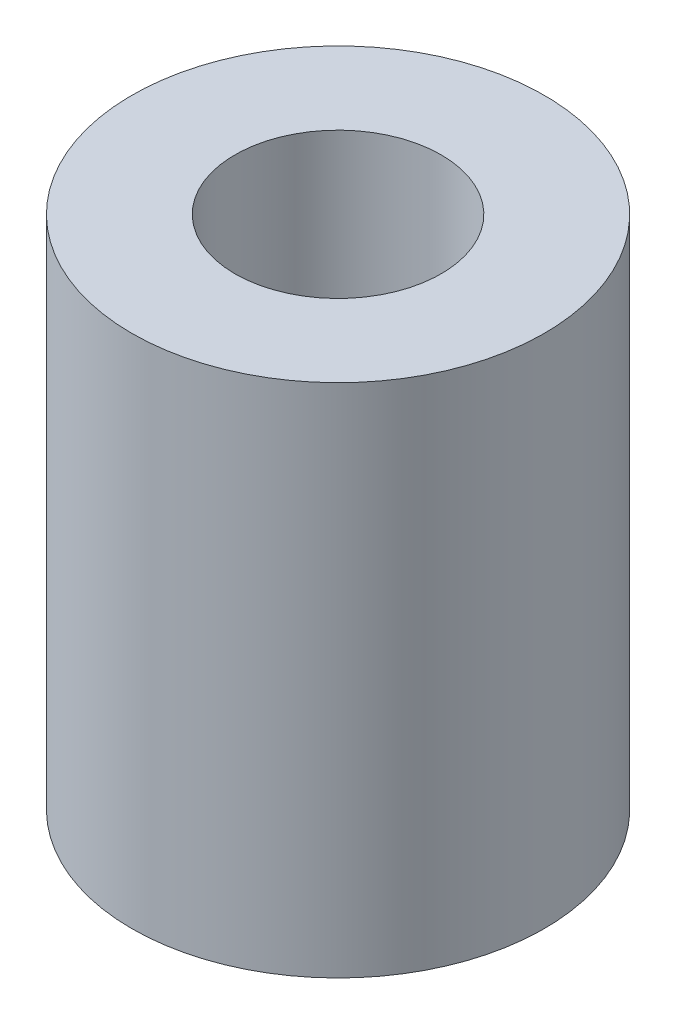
from build123d import *

# Parameters (mm, degrees)
SKETCH_1_R          = 16
EXTRUDE_1_DEPTH     = 40
SKETCH_2_R          = 8
CUT_EXTRUDE_1_DEPTH = 20
SKETCH_3_R          = 4
CUT_EXTRUDE_2_DEPTH = 20


with BuildPart() as part:
    # Sketch 1 → Extrude 1 (new body)
    with BuildSketch(Plane(origin=(0, 0, 0), x_dir=(1, 0, 0), z_dir=(0, 1, 0))):
        with Locations(Location((0, 0, 0), (0, 0, 270))):
            Circle(SKETCH_1_R)
    extrude(amount=EXTRUDE_1_DEPTH)

    # Sketch 2 → Cut-Extrude 1 (cut)
    with BuildSketch(Plane(origin=(0, 40, 0), x_dir=(1, 0, 0), z_dir=(0, 1, 0))):
        with Locations(Location((0, 0, 0), (0, 0, 270))):
            Circle(SKETCH_2_R)
    extrude(amount=-CUT_EXTRUDE_1_DEPTH, mode=Mode.SUBTRACT)

    # Sketch 3 → Cut-Extrude 2 (cut)
    with BuildSketch(Plane.XZ):
        with Locations(Location((0, 0, 0), (0, 0, 270))):
            Circle(SKETCH_3_R)
    extrude(amount=-CUT_EXTRUDE_2_DEPTH, mode=Mode.SUBTRACT)


solid = part.part
